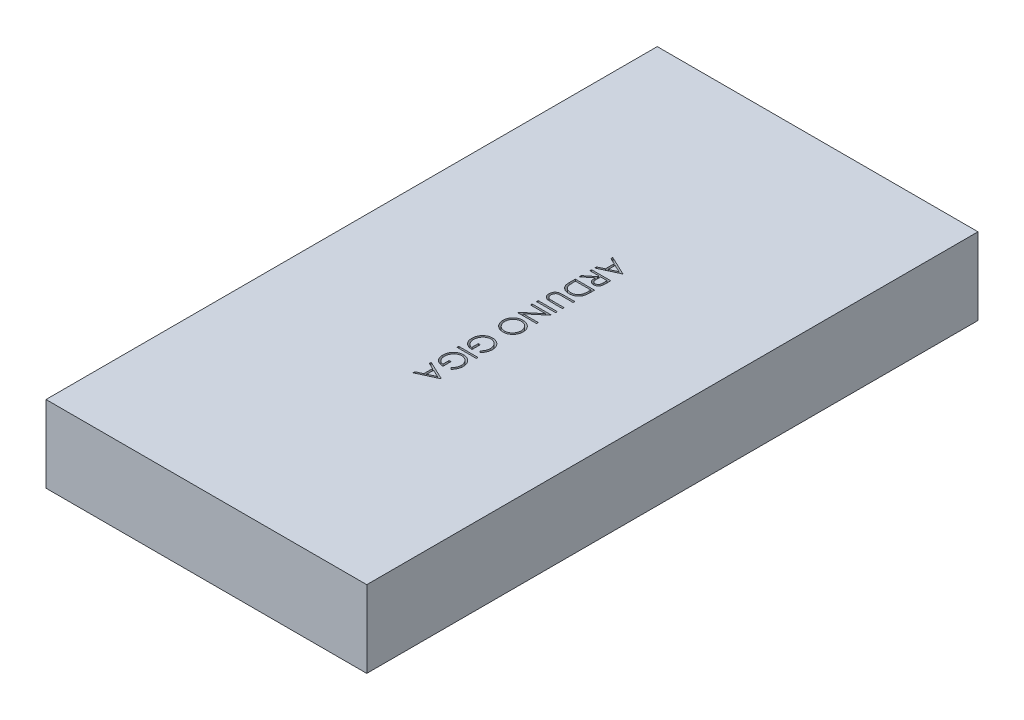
from build123d import *

# Parameters (mm, degrees)
SKETCH1_W           = 53
SKETCH1_H           = 101
BOSS_EXTRUDE1_DEPTH = 12.7
SKETCH2_W           = 3.175
SKETCH2_H           = 0.284935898
CUT_EXTRUDE1_DEPTH  = 6.35


with BuildPart() as part:
    # Sketch1 → Boss-Extrude1 (new body)
    with BuildSketch(Plane(origin=(0, 0, 0), x_dir=(1, 0, 0), z_dir=(0, 1, 0))):
        with Locations((26.5, 50.5)):
            Rectangle(SKETCH1_W, SKETCH1_H)
    extrude(amount=BOSS_EXTRUDE1_DEPTH)

    # Sketch2 → Cut-Extrude1 (cut)
    # profile 1 of 11: a face of its own
    with BuildSketch(Plane(origin=(0, 12.7, 0), x_dir=(1, 0, 0), z_dir=(0, 1, 0))):
        Polygon((29.675, 65.601602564), (26.5, 64.136217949), (26.5, 64.445958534), (27.517628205, 64.915339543), (27.517628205, 66.354647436), (26.5, 66.836748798), (26.5, 67.148397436), (29.675, 65.642307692), align=None)
        Polygon((29.05551883, 65.625135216), (27.843269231, 66.199459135), (27.843269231, 65.065439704), align=None, mode=Mode.SUBTRACT)
    # profile 2 of 11: a face of its own
    with BuildSketch(Plane(origin=(0, 12.7, 0), x_dir=(1, 0, 0), z_dir=(0, 1, 0))):
        with BuildLine():
            Line((29.675, 63.64775641), (29.675, 63.0123748))
            add(Edge.make_bspline(
                [(29.675, 63.0123748), (29.674858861, 62.969973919), (29.674587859, 62.888559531), (29.673076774, 62.771925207), (29.668745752, 62.66594634), (29.66501868, 62.570678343), (29.658222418, 62.486122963), (29.651726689, 62.412020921), (29.643223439, 62.34871351), (29.635326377, 62.310390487), (29.631750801, 62.293038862)],
                knots=[0, 0, 0, 0, 1.410062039, 2.707475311, 3.878576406, 4.937260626, 5.877586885, 6.699081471, 7.410979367, 8, 8, 8, 8], degree=3))
            add(Edge.make_bspline(
                [(29.631750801, 62.293038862), (29.626012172, 62.269809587), (29.614657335, 62.22384658), (29.590645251, 62.157676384), (29.562903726, 62.094595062), (29.53006737, 62.034839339), (29.492708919, 61.978403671), (29.450610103, 61.925372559), (29.403556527, 61.876049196), (29.352749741, 61.830054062), (29.297746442, 61.788360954), (29.239347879, 61.752281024), (29.1779193, 61.721385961), (29.113246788, 61.696721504), (29.045877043, 61.676879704), (28.9752218, 61.662884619), (28.901596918, 61.654492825), (28.851379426, 61.653638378), (28.825916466, 61.653205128)],
                knots=[0, 0, 0, 0, 1.02737288, 2.032829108, 3.019628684, 3.985738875, 4.958353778, 5.924249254, 6.890702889, 7.883913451, 8.865824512, 9.85161466, 10.829249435, 11.81541824, 12.821369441, 13.843154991, 14.906364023, 16, 16, 16, 16], degree=3))
            add(Edge.make_bspline(
                [(28.825916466, 61.653205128), (28.783611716, 61.654537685), (28.70106419, 61.657137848), (28.581266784, 61.681381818), (28.469513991, 61.721091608), (28.365961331, 61.775819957), (28.272572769, 61.84548211), (28.190823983, 61.929200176), (28.121783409, 62.026546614), (28.07441549, 62.117595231), (28.043936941, 62.198060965), (28.022384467, 62.264499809), (28.006013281, 62.337028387), (27.99113416, 62.414606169), (27.979780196, 62.497832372), (27.971716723, 62.586539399), (27.966531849, 62.680949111), (27.965774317, 62.745664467), (27.965384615, 62.77895633)],
                knots=[0, 0, 0, 0, 1.260402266, 2.459371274, 3.627181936, 4.786749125, 5.93865593, 7.087644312, 8.261344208, 9.485713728, 10.136162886, 10.825977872, 11.566646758, 12.35154167, 13.181268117, 14.0701832, 15.007234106, 16, 16, 16, 16], degree=3))
            Line((27.965384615, 62.77895633), (26.5, 61.6125))
            Line((26.5, 61.6125), (26.5, 61.964853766))
            Line((26.5, 61.964853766), (27.965384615, 63.131310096))
            Line((27.965384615, 63.131310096), (27.965384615, 63.362820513))
            Line((27.965384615, 63.362820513), (26.5, 63.362820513))
            Line((26.5, 63.362820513), (26.5, 63.64775641))
            Line((26.5, 63.64775641), (29.675, 63.64775641))
        make_face()
        with BuildLine():
            Line((29.349358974, 63.362820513), (28.291025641, 63.362820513))
            Line((28.291025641, 63.362820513), (28.286573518, 62.781500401))
            add(Edge.make_bspline(
                [(28.286573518, 62.781500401), (28.28656151, 62.754358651), (28.286538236, 62.70175021), (28.290161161, 62.62564032), (28.294282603, 62.554774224), (28.300586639, 62.489422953), (28.30871112, 62.429557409), (28.318873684, 62.375207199), (28.330714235, 62.326284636), (28.349038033, 62.269224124), (28.378085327, 62.205526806), (28.420274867, 62.13621561), (28.47368347, 62.077391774), (28.533784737, 62.026674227), (28.601223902, 61.987608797), (28.673007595, 61.959176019), (28.748516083, 61.941332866), (28.800379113, 61.939211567), (28.826552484, 61.938141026)],
                knots=[0, 0, 0, 0, 1.14660753, 2.222451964, 3.218720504, 4.145691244, 4.995719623, 5.770487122, 6.480909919, 7.121111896, 8.299844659, 9.430703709, 10.534634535, 11.641396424, 12.741395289, 13.810956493, 14.895269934, 16, 16, 16, 16], degree=3))
            add(Edge.make_bspline(
                [(28.826552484, 61.938141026), (28.852092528, 61.939214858), (28.902703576, 61.941342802), (28.976593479, 61.959210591), (29.046830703, 61.988064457), (29.11207648, 62.028524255), (29.171795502, 62.077413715), (29.222186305, 62.135477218), (29.264385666, 62.199790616), (29.291155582, 62.259943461), (29.307600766, 62.313671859), (29.319158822, 62.360328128), (29.328523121, 62.413246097), (29.335803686, 62.472298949), (29.342355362, 62.537379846), (29.346603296, 62.608666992), (29.349170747, 62.686078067), (29.349294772, 62.73973301), (29.349358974, 62.767508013)],
                knots=[0, 0, 0, 0, 1.100801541, 2.181386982, 3.260112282, 4.364594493, 5.481957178, 6.577424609, 7.668452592, 8.790448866, 9.403819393, 10.091598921, 10.863153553, 11.720938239, 12.658472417, 13.685008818, 14.801622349, 16, 16, 16, 16], degree=3))
            Line((29.349358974, 62.767508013), (29.349358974, 63.362820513))
        make_face(mode=Mode.SUBTRACT)
    # profile 3 of 11: a face of its own
    with BuildSketch(Plane(origin=(0, 12.7, 0), x_dir=(1, 0, 0), z_dir=(0, 1, 0))):
        with BuildLine():
            Line((26.5, 60.961217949), (29.675, 60.961217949))
            Line((29.675, 60.961217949), (29.675, 60.320112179))
            add(Edge.make_bspline(
                [(29.675, 60.320112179), (29.67459962, 60.26435091), (29.673826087, 60.156620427), (29.668893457, 60.000944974), (29.660255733, 59.85711086), (29.647431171, 59.725199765), (29.632038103, 59.604999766), (29.612461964, 59.496703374), (29.589439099, 59.400135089), (29.569802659, 59.340745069), (29.560516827, 59.312660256)],
                knots=[0, 0, 0, 0, 1.314317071, 2.539253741, 3.67075822, 4.709970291, 5.662644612, 6.526156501, 7.303037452, 8, 8, 8, 8], degree=3))
            add(Edge.make_bspline(
                [(29.560516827, 59.312660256), (29.546518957, 59.275925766), (29.518840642, 59.203289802), (29.466629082, 59.099868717), (29.407470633, 59.00251054), (29.341292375, 58.910685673), (29.2662016, 58.826519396), (29.185458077, 58.746618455), (29.095762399, 58.674569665), (29.000160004, 58.60748167), (28.89768105, 58.548778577), (28.790405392, 58.497009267), (28.678533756, 58.452807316), (28.56125188, 58.41831762), (28.439685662, 58.389823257), (28.312914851, 58.370704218), (28.181678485, 58.358004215), (28.092619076, 58.356734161), (28.047430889, 58.356089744)],
                knots=[0, 0, 0, 0, 0.98467389, 1.947018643, 2.898343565, 3.837828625, 4.779009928, 5.722093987, 6.681368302, 7.658573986, 8.646467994, 9.637429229, 10.641859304, 11.657149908, 12.698561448, 13.768651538, 14.867827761, 16, 16, 16, 16], degree=3))
            add(Edge.make_bspline(
                [(28.047430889, 58.356089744), (28.008186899, 58.356660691), (27.930852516, 58.357785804), (27.816876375, 58.36787618), (27.706290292, 58.382570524), (27.599579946, 58.405216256), (27.496026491, 58.433042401), (27.396121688, 58.467388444), (27.299792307, 58.50809183), (27.207823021, 58.555315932), (27.120365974, 58.606953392), (27.038926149, 58.663570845), (26.961954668, 58.721919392), (26.892923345, 58.786498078), (26.827884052, 58.852856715), (26.770350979, 58.924514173), (26.717818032, 58.999135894), (26.670668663, 59.078159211), (26.629761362, 59.163478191), (26.594716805, 59.256257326), (26.565861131, 59.356993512), (26.541747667, 59.465532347), (26.522630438, 59.582086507), (26.509814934, 59.706762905), (26.501149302, 59.83937214), (26.500390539, 59.930430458), (26.5, 59.977298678)],
                knots=[0, 0, 0, 0, 1.105818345, 2.179130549, 3.222742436, 4.24813173, 5.251184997, 6.243232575, 7.223185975, 8.195898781, 9.155064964, 10.083206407, 10.990357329, 11.874224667, 12.744762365, 13.607037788, 14.46074101, 15.315384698, 16.197310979, 17.123950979, 18.107232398, 19.148086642, 20.256146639, 21.433991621, 22.679261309, 24, 24, 24, 24], degree=3))
            Line((26.5, 59.977298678), (26.5, 60.961217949))
        make_face()
        with BuildLine():
            Line((26.825641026, 60.676282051), (26.825641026, 60.31184395))
            add(Edge.make_bspline(
                [(26.825641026, 60.31184395), (26.825866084, 60.259476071), (26.826298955, 60.158753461), (26.830097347, 60.013920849), (26.836303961, 59.881587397), (26.844989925, 59.761734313), (26.856482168, 59.65442927), (26.869295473, 59.559448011), (26.885258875, 59.477101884), (26.899728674, 59.427273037), (26.906415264, 59.404246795)],
                knots=[0, 0, 0, 0, 1.375205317, 2.645023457, 3.804390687, 4.853969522, 5.800190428, 6.637939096, 7.370582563, 8, 8, 8, 8], degree=3))
            add(Edge.make_bspline(
                [(26.906415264, 59.404246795), (26.916621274, 59.375264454), (26.936789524, 59.317992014), (26.973592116, 59.235558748), (27.017132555, 59.158639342), (27.065816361, 59.085950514), (27.120397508, 59.01796295), (27.181041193, 58.954978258), (27.247076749, 58.896548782), (27.318751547, 58.843313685), (27.395602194, 58.795745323), (27.476650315, 58.754284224), (27.561700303, 58.719105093), (27.651058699, 58.690499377), (27.744641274, 58.668331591), (27.842201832, 58.652559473), (27.943770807, 58.642754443), (28.012851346, 58.641609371), (28.048066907, 58.641025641)],
                knots=[0, 0, 0, 0, 0.998463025, 1.973077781, 2.929496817, 3.867873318, 4.813809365, 5.759268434, 6.706333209, 7.676553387, 8.657505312, 9.640584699, 10.632319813, 11.645628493, 12.686877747, 13.755137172, 14.855624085, 16, 16, 16, 16], degree=3))
            add(Edge.make_bspline(
                [(28.048066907, 58.641025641), (28.085199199, 58.641491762), (28.158145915, 58.642407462), (28.265183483, 58.653897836), (28.368115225, 58.670725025), (28.467015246, 58.694929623), (28.561754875, 58.726199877), (28.652869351, 58.763617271), (28.739186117, 58.80904786), (28.821436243, 58.86048009), (28.898374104, 58.918222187), (28.969098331, 58.98201801), (29.033740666, 59.051194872), (29.09240403, 59.125433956), (29.144045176, 59.205773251), (29.189984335, 59.290853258), (29.229016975, 59.381872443), (29.249769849, 59.445203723), (29.260316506, 59.477388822)],
                knots=[0, 0, 0, 0, 1.122272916, 2.204715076, 3.251197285, 4.274229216, 5.279697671, 6.265416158, 7.248880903, 8.225321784, 9.195852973, 10.153576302, 11.101466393, 12.055578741, 13.010401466, 13.985536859, 14.976245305, 16, 16, 16, 16], degree=3))
            add(Edge.make_bspline(
                [(29.260316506, 59.477388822), (29.267679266, 59.504014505), (29.283334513, 59.560628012), (29.300411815, 59.653010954), (29.315474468, 59.756983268), (29.328227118, 59.873006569), (29.337377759, 60.000948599), (29.344246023, 60.140907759), (29.348878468, 60.292944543), (29.349194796, 60.398338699), (29.349358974, 60.453039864)],
                knots=[0, 0, 0, 0, 0.674548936, 1.434276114, 2.292660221, 3.240891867, 4.284742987, 5.42552168, 6.663806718, 8, 8, 8, 8], degree=3))
            Line((29.349358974, 60.453039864), (29.349358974, 60.676282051))
            Line((29.349358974, 60.676282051), (26.825641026, 60.676282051))
        make_face(mode=Mode.SUBTRACT)
    # profile 4 of 11: a face of its own
    with BuildSketch(Plane(origin=(0, 12.7, 0), x_dir=(1, 0, 0), z_dir=(0, 1, 0))):
        with BuildLine():
            Line((29.675, 57.704807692), (29.675, 57.419871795))
            Line((29.675, 57.419871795), (27.772671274, 57.419871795))
            add(Edge.make_bspline(
                [(27.772671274, 57.419871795), (27.745746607, 57.419914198), (27.69465241, 57.419994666), (27.621928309, 57.419457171), (27.557274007, 57.417951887), (27.500440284, 57.417002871), (27.451687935, 57.414891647), (27.410752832, 57.413169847), (27.377828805, 57.410955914), (27.358614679, 57.408295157), (27.350355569, 57.407151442)],
                knots=[0, 0, 0, 0, 1.528628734, 2.90083645, 4.128790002, 5.200304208, 6.127813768, 6.898992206, 7.526736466, 8, 8, 8, 8], degree=3))
            add(Edge.make_bspline(
                [(27.350355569, 57.407151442), (27.320556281, 57.402459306), (27.26263679, 57.39333942), (27.180205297, 57.370012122), (27.105659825, 57.337695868), (27.037513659, 57.29834903), (26.976779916, 57.247748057), (26.92039437, 57.18752284), (26.871681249, 57.113875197), (26.826865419, 57.032036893), (26.790896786, 56.94377387), (26.763685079, 56.853596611), (26.74710438, 56.762842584), (26.745184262, 56.702085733), (26.744230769, 56.671915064)],
                knots=[0, 0, 0, 0, 1.035924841, 2.013479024, 2.933602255, 3.82183108, 4.706948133, 5.639927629, 6.646101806, 7.731477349, 8.84205456, 9.913728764, 10.963998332, 12, 12, 12, 12], degree=3))
            add(Edge.make_bspline(
                [(26.744230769, 56.671915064), (26.745204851, 56.646012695), (26.747147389, 56.594357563), (26.759178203, 56.517608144), (26.780856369, 56.442856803), (26.808844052, 56.369750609), (26.84576491, 56.301177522), (26.888709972, 56.237186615), (26.938348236, 56.17946385), (26.99406505, 56.127408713), (27.056356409, 56.081832), (27.125034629, 56.043377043), (27.199873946, 56.010966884), (27.252646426, 55.995083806), (27.279757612, 55.986924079)],
                knots=[0, 0, 0, 0, 0.994510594, 1.983277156, 2.972612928, 3.9776239, 4.982470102, 5.955333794, 6.930747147, 7.898149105, 8.876444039, 9.885893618, 10.913904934, 12, 12, 12, 12], degree=3))
            add(Edge.make_bspline(
                [(27.279757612, 55.986924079), (27.290959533, 55.984202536), (27.315921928, 55.978137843), (27.358123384, 55.972470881), (27.407915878, 55.966568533), (27.465657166, 55.962473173), (27.531153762, 55.958480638), (27.604746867, 55.956092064), (27.686169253, 55.954988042), (27.742990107, 55.954659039), (27.772671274, 55.954487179)],
                knots=[0, 0, 0, 0, 0.558680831, 1.244966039, 2.062412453, 2.990489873, 4.051219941, 5.244515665, 6.560634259, 8, 8, 8, 8], degree=3))
            Line((27.772671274, 55.954487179), (29.675, 55.954487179))
            Line((29.675, 55.954487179), (29.675, 55.669551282))
            Line((29.675, 55.669551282), (27.757406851, 55.669551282))
            add(Edge.make_bspline(
                [(27.757406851, 55.669551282), (27.722845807, 55.669779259), (27.655397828, 55.670224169), (27.556568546, 55.674160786), (27.462794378, 55.68025608), (27.374194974, 55.689470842), (27.290664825, 55.699643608), (27.212325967, 55.714198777), (27.13865312, 55.729414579), (27.069772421, 55.748660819), (27.004772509, 55.771878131), (26.941938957, 55.799061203), (26.881785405, 55.832323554), (26.823443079, 55.870280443), (26.766832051, 55.912422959), (26.713281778, 55.960997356), (26.661036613, 56.013488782), (26.611820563, 56.071002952), (26.566364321, 56.13251202), (26.527262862, 56.19812525), (26.492929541, 56.266521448), (26.465809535, 56.338433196), (26.444818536, 56.4133921), (26.429370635, 56.491394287), (26.420557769, 56.572705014), (26.419251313, 56.628009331), (26.418589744, 56.656014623)],
                knots=[0, 0, 0, 0, 1.316364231, 2.568964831, 3.766826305, 4.894964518, 5.961692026, 6.970710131, 7.928946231, 8.826316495, 9.692177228, 10.556379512, 11.43093279, 12.306715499, 13.20629939, 14.115652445, 15.057829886, 16.025681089, 16.996391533, 17.967202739, 18.931442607, 19.907779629, 20.889445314, 21.893507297, 22.933303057, 24, 24, 24, 24], degree=3))
            add(Edge.make_bspline(
                [(26.418589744, 56.656014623), (26.419301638, 56.686557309), (26.420698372, 56.74648195), (26.428701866, 56.834781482), (26.443777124, 56.919430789), (26.462972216, 57.001323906), (26.489446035, 57.0793459), (26.520377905, 57.154542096), (26.558366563, 57.225624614), (26.600633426, 57.293746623), (26.648190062, 57.357087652), (26.700024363, 57.415233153), (26.755305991, 57.468279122), (26.814633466, 57.515331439), (26.877545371, 57.55716967), (26.944219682, 57.593210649), (27.014630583, 57.624156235), (27.063573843, 57.640127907), (27.088316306, 57.648202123)],
                knots=[0, 0, 0, 0, 1.13879206, 2.234305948, 3.301075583, 4.341971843, 5.366689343, 6.369221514, 7.369726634, 8.367512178, 9.355451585, 10.318319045, 11.268648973, 12.207971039, 13.137398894, 14.081662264, 15.030215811, 16, 16, 16, 16], degree=3))
            add(Edge.make_bspline(
                [(27.088316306, 57.648202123), (27.105218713, 57.652898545), (27.14188041, 57.663085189), (27.20255601, 57.673993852), (27.272419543, 57.683164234), (27.351475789, 57.691787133), (27.439786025, 57.696875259), (27.53731197, 57.701336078), (27.64417155, 57.704839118), (27.718606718, 57.70481846), (27.757406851, 57.704807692)],
                knots=[0, 0, 0, 0, 0.625038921, 1.35572334, 2.194682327, 3.136881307, 4.189498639, 5.346923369, 6.617055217, 8, 8, 8, 8], degree=3))
            Line((27.757406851, 57.704807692), (29.675, 57.704807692))
        make_face()
    # profile 5 of 11: a face of its own
    with BuildSketch(Plane(origin=(0, 12.7, 0), x_dir=(1, 0, 0), z_dir=(0, 1, 0))):
        with Locations((28.0875, 54.672275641)):
            Rectangle(SKETCH2_W, SKETCH2_H)
    # profile 6 of 11: a face of its own
    with BuildSketch(Plane(origin=(0, 12.7, 0), x_dir=(1, 0, 0), z_dir=(0, 1, 0))):
        Polygon((26.5, 53.837820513), (29.675, 53.837820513), (29.675, 53.778034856), (27.176086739, 51.680448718), (29.675, 51.680448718), (29.675, 51.395512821), (26.5, 51.395512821), (26.5, 51.460386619), (28.993189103, 53.552884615), (26.5, 53.552884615), align=None)
    # profile 7 of 11: a face of its own
    with BuildSketch(Plane(origin=(0, 12.7, 0), x_dir=(1, 0, 0), z_dir=(0, 1, 0))):
        with BuildLine():
            add(Edge.make_bspline(
                [(29.756410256, 49.095673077), (29.754921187, 49.036882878), (29.751996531, 48.921414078), (29.729609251, 48.751710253), (29.690877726, 48.589699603), (29.639297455, 48.434058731), (29.570477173, 48.286662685), (29.487341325, 48.146352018), (29.388707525, 48.013523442), (29.276230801, 47.889394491), (29.153405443, 47.776221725), (29.02195078, 47.677343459), (28.883666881, 47.593742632), (28.738072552, 47.525220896), (28.585808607, 47.471416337), (28.426009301, 47.434300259), (28.259724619, 47.41058831), (28.146307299, 47.407816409), (28.088772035, 47.406410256)],
                knots=[0, 0, 0, 0, 1.06508495, 2.091914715, 3.094501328, 4.079693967, 5.057647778, 6.035986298, 7.030177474, 8.050107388, 9.066943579, 10.051896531, 11.025616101, 11.9896488, 12.96281505, 13.945825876, 14.957941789, 16, 16, 16, 16], degree=3))
            add(Edge.make_bspline(
                [(28.088772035, 47.406410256), (28.031660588, 47.407816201), (27.91908731, 47.410587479), (27.753857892, 47.434327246), (27.595023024, 47.471553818), (27.442863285, 47.524721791), (27.297160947, 47.592914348), (27.158622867, 47.677080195), (27.026258, 47.775303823), (26.902836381, 47.888085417), (26.789441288, 48.010881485), (26.690409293, 48.14270684), (26.605779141, 48.280854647), (26.53772739, 48.426360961), (26.483542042, 48.577603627), (26.446563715, 48.735968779), (26.4227203, 48.900749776), (26.419981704, 49.013118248), (26.418589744, 49.070232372)],
                knots=[0, 0, 0, 0, 1.04355943, 2.056976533, 3.044937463, 4.02179873, 4.997890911, 5.980248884, 6.980147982, 8.006253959, 9.032111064, 10.031228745, 11.015595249, 11.988180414, 12.962670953, 13.946861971, 14.95644057, 16, 16, 16, 16], degree=3))
            add(Edge.make_bspline(
                [(26.418589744, 49.070232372), (26.41999507, 49.127767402), (26.422765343, 49.241184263), (26.446518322, 49.40767696), (26.483648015, 49.567591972), (26.536760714, 49.720436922), (26.60514423, 49.866261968), (26.689177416, 50.005053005), (26.788198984, 50.136976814), (26.900830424, 50.260690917), (27.023685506, 50.373748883), (27.154644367, 50.473189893), (27.292461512, 50.556738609), (27.436568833, 50.625150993), (27.586593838, 50.679262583), (27.74348024, 50.716191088), (27.906348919, 50.740080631), (28.017240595, 50.742833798), (28.073507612, 50.744230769)],
                knots=[0, 0, 0, 0, 1.053167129, 2.076072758, 3.073341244, 4.055601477, 5.033424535, 6.017524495, 7.021518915, 8.049444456, 9.077120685, 10.074910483, 11.055688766, 12.022980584, 12.991883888, 13.970269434, 14.970104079, 16, 16, 16, 16], degree=3))
            add(Edge.make_bspline(
                [(28.073507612, 50.744230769), (28.111274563, 50.743746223), (28.186332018, 50.742783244), (28.297787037, 50.731172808), (28.407461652, 50.714359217), (28.514987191, 50.690136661), (28.620381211, 50.658891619), (28.723428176, 50.620387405), (28.82497689, 50.57626156), (28.923094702, 50.523723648), (29.017935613, 50.466403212), (29.108313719, 50.403901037), (29.19261462, 50.335781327), (29.272192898, 50.263017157), (29.345690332, 50.184601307), (29.414709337, 50.101713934), (29.478535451, 50.013921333), (29.535828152, 49.921084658), (29.588452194, 49.825570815), (29.632388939, 49.726686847), (29.671223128, 49.626519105), (29.702084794, 49.524185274), (29.72664469, 49.419922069), (29.74333252, 49.313599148), (29.754968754, 49.205326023), (29.755927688, 49.132381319), (29.756410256, 49.095673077)],
                knots=[0, 0, 0, 0, 1.037115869, 2.061148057, 3.07517727, 4.084041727, 5.086514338, 6.092668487, 7.104487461, 8.125783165, 9.147610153, 10.147694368, 11.141876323, 12.122903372, 13.107606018, 14.091946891, 15.084523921, 16.086505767, 17.087268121, 18.077809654, 19.05670789, 20.036870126, 21.011670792, 21.99694167, 22.991993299, 24, 24, 24, 24], degree=3))
        make_face()
        with BuildLine():
            add(Edge.make_bspline(
                [(29.430769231, 49.081680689), (29.430402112, 49.111811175), (29.429671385, 49.171784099), (29.420038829, 49.260941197), (29.406323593, 49.348930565), (29.386709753, 49.435747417), (29.360231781, 49.520924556), (29.329033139, 49.605312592), (29.292332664, 49.688506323), (29.249538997, 49.769575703), (29.202791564, 49.848385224), (29.151484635, 49.923260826), (29.095866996, 49.993455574), (29.036673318, 50.059194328), (28.973301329, 50.120285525), (28.90676245, 50.177967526), (28.835141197, 50.229918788), (28.760383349, 50.27753082), (28.6825853, 50.32013733), (28.602566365, 50.358024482), (28.519673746, 50.389016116), (28.434806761, 50.414291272), (28.348099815, 50.435246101), (28.258895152, 50.44852116), (28.167641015, 50.458256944), (28.105971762, 50.458946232), (28.074779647, 50.459294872)],
                knots=[0, 0, 0, 0, 1.008585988, 2.007529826, 2.999688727, 3.990042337, 4.984966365, 5.984641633, 7.001812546, 8.027570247, 9.052811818, 10.068991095, 11.064725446, 12.050001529, 13.029093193, 14.010961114, 14.996492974, 15.989185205, 16.977398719, 17.96520407, 18.951579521, 19.937648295, 20.929603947, 21.935788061, 22.955928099, 24, 24, 24, 24], degree=3))
            add(Edge.make_bspline(
                [(28.074779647, 50.459294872), (28.02891249, 50.45813839), (27.938677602, 50.455863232), (27.806445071, 50.435944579), (27.679364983, 50.405263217), (27.55813268, 50.360035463), (27.44170608, 50.303474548), (27.331118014, 50.233600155), (27.226338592, 50.150815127), (27.128099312, 50.0567775), (27.038432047, 49.953977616), (26.959725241, 49.844818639), (26.893131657, 49.73047001), (26.838879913, 49.610633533), (26.79589065, 49.48594898), (26.766427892, 49.355612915), (26.747037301, 49.22049357), (26.745175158, 49.128390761), (26.744230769, 49.081680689)],
                knots=[0, 0, 0, 0, 1.032063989, 2.030389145, 3.003944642, 3.970395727, 4.937377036, 5.913328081, 6.909231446, 7.93887556, 8.970685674, 9.976071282, 10.964166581, 11.944589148, 12.933237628, 13.927779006, 14.949070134, 16, 16, 16, 16], degree=3))
            add(Edge.make_bspline(
                [(26.744230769, 49.081680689), (26.744662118, 49.050284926), (26.745517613, 48.988017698), (26.754134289, 48.895402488), (26.7679517, 48.804455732), (26.787846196, 48.715305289), (26.812743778, 48.628051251), (26.842327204, 48.542333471), (26.879217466, 48.459049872), (26.920042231, 48.377206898), (26.966247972, 48.298852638), (27.016837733, 48.224513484), (27.071460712, 48.154620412), (27.13014036, 48.089022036), (27.192370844, 48.027507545), (27.259752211, 47.971747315), (27.330316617, 47.919173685), (27.405248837, 47.871752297), (27.483210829, 47.829230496), (27.563532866, 47.792255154), (27.645938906, 47.760866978), (27.730568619, 47.735533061), (27.817255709, 47.71567949), (27.906117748, 47.701999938), (27.996976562, 47.692430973), (28.058429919, 47.691709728), (28.089408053, 47.691346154)],
                knots=[0, 0, 0, 0, 1.047226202, 2.076964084, 3.100341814, 4.114585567, 5.122123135, 6.126552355, 7.137064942, 8.158803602, 9.176592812, 10.169297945, 11.156925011, 12.133779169, 13.104132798, 14.073170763, 15.049307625, 16.038276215, 17.028988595, 18.010110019, 18.986169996, 19.968539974, 20.955178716, 21.950601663, 22.966915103, 24, 24, 24, 24], degree=3))
            add(Edge.make_bspline(
                [(28.089408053, 47.691346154), (28.12017426, 47.691710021), (28.1812047, 47.692431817), (28.271429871, 47.701995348), (28.359652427, 47.715694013), (28.44552602, 47.735435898), (28.529072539, 47.760881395), (28.610213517, 47.792257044), (28.689251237, 47.829255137), (28.765990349, 47.871716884), (28.839627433, 47.919446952), (28.910023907, 47.971602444), (28.975857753, 48.029083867), (29.038754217, 48.090248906), (29.097371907, 48.156625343), (29.151730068, 48.22791256), (29.203141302, 48.303244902), (29.249517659, 48.38300799), (29.292354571, 48.465323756), (29.329024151, 48.549798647), (29.36036671, 48.635623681), (29.386601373, 48.722359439), (29.406342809, 48.81061694), (29.420033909, 48.899882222), (29.429672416, 48.990307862), (29.430402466, 49.051126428), (29.430769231, 49.081680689)],
                knots=[0, 0, 0, 0, 1.029967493, 2.04313025, 3.035375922, 4.01889446, 4.991458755, 5.958017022, 6.930036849, 7.912118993, 8.892942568, 9.867138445, 10.843712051, 11.817804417, 12.803729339, 13.806387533, 14.818654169, 15.856205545, 16.894655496, 17.924916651, 18.938004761, 19.953404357, 20.957695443, 21.963967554, 22.97713031, 24, 24, 24, 24], degree=3))
        make_face(mode=Mode.SUBTRACT)
    # profile 8 of 11: a face of its own
    with BuildSketch(Plane(origin=(0, 12.7, 0), x_dir=(1, 0, 0), z_dir=(0, 1, 0))):
        with BuildLine():
            Line((29.133112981, 42.5625), (28.901602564, 42.806730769))
            add(Edge.make_bspline(
                [(28.901602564, 42.806730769), (28.943106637, 42.851193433), (29.024904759, 42.938822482), (29.132390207, 43.080760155), (29.222851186, 43.229647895), (29.297735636, 43.38327121), (29.356944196, 43.538887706), (29.398871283, 43.694001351), (29.426025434, 43.846937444), (29.429201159, 43.948486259), (29.430769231, 43.998627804)],
                knots=[0, 0, 0, 0, 1.09204548, 2.152253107, 3.191356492, 4.216655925, 5.218178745, 6.177092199, 7.099906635, 8, 8, 8, 8], degree=3))
            add(Edge.make_bspline(
                [(29.430769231, 43.998627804), (29.430393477, 44.02939311), (29.429642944, 44.090843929), (29.420086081, 44.182124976), (29.406298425, 44.272436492), (29.386554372, 44.36146704), (29.360910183, 44.449570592), (29.329948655, 44.53655116), (29.292677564, 44.622240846), (29.250185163, 44.706188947), (29.203797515, 44.787988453), (29.152062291, 44.864922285), (29.096568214, 44.937306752), (29.036599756, 45.004646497), (28.973110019, 45.067802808), (28.905235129, 45.125955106), (28.833467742, 45.179395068), (28.757814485, 45.227506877), (28.679995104, 45.270464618), (28.600719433, 45.308462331), (28.520070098, 45.340049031), (28.438514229, 45.366261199), (28.355881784, 45.386796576), (28.2721706, 45.401488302), (28.187094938, 45.409712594), (28.130129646, 45.41114093), (28.101492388, 45.411858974)],
                knots=[0, 0, 0, 0, 1.028345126, 2.054023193, 3.065714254, 4.082262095, 5.100859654, 6.132352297, 7.167492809, 8.223256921, 9.277568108, 10.309840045, 11.320860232, 12.32524711, 13.322830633, 14.313234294, 15.3114222, 16.312425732, 17.308799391, 18.282312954, 19.249923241, 20.202773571, 21.145015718, 22.094907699, 23.042283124, 24, 24, 24, 24], degree=3))
            add(Edge.make_bspline(
                [(28.101492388, 45.411858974), (28.072219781, 45.411167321), (28.013754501, 45.409785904), (27.926468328, 45.401113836), (27.840645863, 45.384514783), (27.755332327, 45.364067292), (27.671632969, 45.335588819), (27.588610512, 45.302011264), (27.507024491, 45.261760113), (27.427371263, 45.21530763), (27.349791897, 45.164331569), (27.276712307, 45.107235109), (27.207162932, 45.0465825), (27.142687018, 44.980167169), (27.08156021, 44.910117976), (27.025466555, 44.834342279), (26.973325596, 44.754330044), (26.925794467, 44.669959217), (26.883332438, 44.582145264), (26.845573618, 44.492105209), (26.814477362, 44.399551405), (26.789133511, 44.304970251), (26.76835967, 44.208474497), (26.754995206, 44.109574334), (26.745297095, 44.008996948), (26.744588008, 43.941198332), (26.744230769, 43.907041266)],
                knots=[0, 0, 0, 0, 0.935842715, 1.869129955, 2.799583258, 3.728257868, 4.6712142, 5.62263184, 6.589468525, 7.576334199, 8.568768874, 9.554260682, 10.538610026, 11.516240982, 12.510802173, 13.508383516, 14.52719334, 15.561971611, 16.601598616, 17.64369662, 18.68095744, 19.719943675, 20.77263142, 21.833597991, 22.908562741, 24, 24, 24, 24], degree=3))
            add(Edge.make_bspline(
                [(26.744230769, 43.907041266), (26.745091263, 43.865876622), (26.746780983, 43.785043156), (26.759934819, 43.666219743), (26.78047869, 43.552098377), (26.810564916, 43.442999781), (26.848940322, 43.338797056), (26.895200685, 43.23910888), (26.951118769, 43.144717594), (27.014235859, 43.055348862), (27.084539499, 42.972997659), (27.160465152, 42.898821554), (27.241269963, 42.83362204), (27.32766765, 42.777941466), (27.41827665, 42.729973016), (27.514710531, 42.691720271), (27.615875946, 42.662130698), (27.685814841, 42.650026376), (27.721153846, 42.643910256)],
                knots=[0, 0, 0, 0, 1.13011591, 2.219166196, 3.278784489, 4.311187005, 5.322345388, 6.325022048, 7.324448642, 8.33076908, 9.325913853, 10.293360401, 11.241630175, 12.171712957, 13.111744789, 14.052245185, 15.015830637, 16, 16, 16, 16], degree=3))
            Line((27.721153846, 42.643910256), (27.721153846, 43.70224359))
            Line((27.721153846, 43.70224359), (28.046794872, 43.70224359))
            Line((28.046794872, 43.70224359), (28.046794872, 42.358974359))
            add(Edge.make_bspline(
                [(28.046794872, 42.358974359), (27.986100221, 42.360521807), (27.867309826, 42.363550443), (27.694072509, 42.384794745), (27.530449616, 42.419099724), (27.376268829, 42.465963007), (27.231748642, 42.52662844), (27.09674232, 42.600444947), (26.972122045, 42.688593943), (26.856870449, 42.787935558), (26.754064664, 42.899423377), (26.663707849, 43.020044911), (26.587596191, 43.149999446), (26.525674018, 43.289164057), (26.477346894, 43.437083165), (26.443082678, 43.594099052), (26.422554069, 43.75999879), (26.419931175, 43.873697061), (26.418589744, 43.931845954)],
                knots=[0, 0, 0, 0, 1.140356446, 2.231883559, 3.274166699, 4.278491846, 5.25512956, 6.21435461, 7.1637429, 8.11826594, 9.068280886, 10.0076534, 10.945064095, 11.891975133, 12.864533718, 13.863980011, 14.907571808, 16, 16, 16, 16], degree=3))
            add(Edge.make_bspline(
                [(26.418589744, 43.931845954), (26.419106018, 43.967687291), (26.420124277, 44.038377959), (26.427360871, 44.142781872), (26.438501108, 44.244307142), (26.455324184, 44.342938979), (26.47592962, 44.439040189), (26.50231543, 44.532130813), (26.53285775, 44.622565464), (26.567597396, 44.710483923), (26.607848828, 44.79508819), (26.652579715, 44.876755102), (26.701559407, 44.955936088), (26.75563496, 45.032091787), (26.814401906, 45.105619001), (26.877978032, 45.176043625), (26.946168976, 45.243759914), (26.994591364, 45.286178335), (27.018990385, 45.307552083)],
                knots=[0, 0, 0, 0, 1.107784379, 2.184907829, 3.233506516, 4.263428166, 5.276301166, 6.270063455, 7.25232949, 8.225834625, 9.190232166, 10.146266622, 11.1027726, 12.066435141, 13.031522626, 14.010570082, 14.99756817, 16, 16, 16, 16], degree=3))
            add(Edge.make_bspline(
                [(27.018990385, 45.307552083), (27.057698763, 45.338563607), (27.134473, 45.400071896), (27.257481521, 45.479245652), (27.384846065, 45.546738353), (27.516921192, 45.601500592), (27.653583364, 45.64426157), (27.79465795, 45.674928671), (27.940326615, 45.692896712), (28.038901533, 45.695485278), (28.088772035, 45.696794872)],
                knots=[0, 0, 0, 0, 1.023165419, 2.029347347, 3.013907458, 3.994755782, 4.975994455, 5.96558838, 6.970761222, 8, 8, 8, 8], degree=3))
            add(Edge.make_bspline(
                [(28.088772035, 45.696794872), (28.126115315, 45.696310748), (28.200327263, 45.695348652), (28.310512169, 45.683733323), (28.41871333, 45.666968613), (28.525030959, 45.642685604), (28.628992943, 45.610735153), (28.731398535, 45.572364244), (28.831836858, 45.527419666), (28.92942362, 45.474976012), (29.024103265, 45.417873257), (29.112977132, 45.353730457), (29.197582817, 45.285706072), (29.276387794, 45.211876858), (29.349735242, 45.132661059), (29.417896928, 45.048497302), (29.481047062, 44.959426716), (29.538168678, 44.865140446), (29.589480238, 44.767053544), (29.634464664, 44.665399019), (29.671642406, 44.560208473), (29.703187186, 44.452269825), (29.726514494, 44.340766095), (29.743431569, 44.226506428), (29.755007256, 44.108895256), (29.755938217, 44.029396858), (29.756410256, 43.98908754)],
                knots=[0, 0, 0, 0, 1.009014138, 2.005204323, 2.991638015, 3.967544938, 4.950092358, 5.929358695, 6.922031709, 7.921874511, 8.922406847, 9.908357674, 10.882125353, 11.855201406, 12.82437151, 13.798139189, 14.780770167, 15.773426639, 16.775664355, 17.771244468, 18.775446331, 19.789330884, 20.808771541, 21.851841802, 22.910785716, 24, 24, 24, 24], degree=3))
            add(Edge.make_bspline(
                [(29.756410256, 43.98908754), (29.755885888, 43.956214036), (29.754846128, 43.89102974), (29.747601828, 43.794036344), (29.736246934, 43.698733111), (29.720369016, 43.604641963), (29.699365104, 43.512121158), (29.673767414, 43.420890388), (29.644130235, 43.331122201), (29.608756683, 43.242923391), (29.568613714, 43.155694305), (29.523425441, 43.068951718), (29.472421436, 42.982991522), (29.415449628, 42.897664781), (29.353488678, 42.812433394), (29.284766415, 42.728645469), (29.211992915, 42.644278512), (29.159666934, 42.590029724), (29.133112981, 42.5625)],
                knots=[0, 0, 0, 0, 0.985875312, 1.954874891, 2.915472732, 3.863573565, 4.815313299, 5.759461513, 6.704487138, 7.649063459, 8.607849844, 9.583336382, 10.581114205, 11.603942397, 12.659508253, 13.739925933, 14.853076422, 16, 16, 16, 16], degree=3))
        make_face()
    # profile 9 of 11: a face of its own
    with BuildSketch(Plane(origin=(0, 12.7, 0), x_dir=(1, 0, 0), z_dir=(0, 1, 0))):
        with Locations((28.0875, 41.565224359)):
            Rectangle(SKETCH2_W, SKETCH2_H)
    # profile 10 of 11: a face of its own
    with BuildSketch(Plane(origin=(0, 12.7, 0), x_dir=(1, 0, 0), z_dir=(0, 1, 0))):
        with BuildLine():
            Line((29.133112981, 37.759294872), (28.901602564, 38.003525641))
            add(Edge.make_bspline(
                [(28.901602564, 38.003525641), (28.943106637, 38.047988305), (29.024904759, 38.135617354), (29.132390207, 38.277555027), (29.222851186, 38.426442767), (29.297735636, 38.580066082), (29.356944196, 38.735682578), (29.398871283, 38.890796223), (29.426025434, 39.043732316), (29.429201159, 39.145281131), (29.430769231, 39.195422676)],
                knots=[0, 0, 0, 0, 1.09204548, 2.152253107, 3.191356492, 4.216655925, 5.218178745, 6.177092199, 7.099906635, 8, 8, 8, 8], degree=3))
            add(Edge.make_bspline(
                [(29.430769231, 39.195422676), (29.430393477, 39.226187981), (29.429642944, 39.2876388), (29.420086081, 39.378919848), (29.406298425, 39.469231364), (29.386554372, 39.558261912), (29.360910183, 39.646365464), (29.329948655, 39.733346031), (29.292677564, 39.819035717), (29.250185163, 39.902983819), (29.203797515, 39.984783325), (29.152062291, 40.061717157), (29.096568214, 40.134101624), (29.036599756, 40.201441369), (28.973110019, 40.26459768), (28.905235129, 40.322749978), (28.833467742, 40.37618994), (28.757814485, 40.424301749), (28.679995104, 40.46725949), (28.600719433, 40.505257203), (28.520070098, 40.536843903), (28.438514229, 40.563056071), (28.355881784, 40.583591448), (28.2721706, 40.598283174), (28.187094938, 40.606507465), (28.130129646, 40.607935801), (28.101492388, 40.608653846)],
                knots=[0, 0, 0, 0, 1.028345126, 2.054023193, 3.065714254, 4.082262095, 5.100859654, 6.132352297, 7.167492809, 8.223256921, 9.277568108, 10.309840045, 11.320860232, 12.32524711, 13.322830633, 14.313234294, 15.3114222, 16.312425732, 17.308799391, 18.282312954, 19.249923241, 20.202773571, 21.145015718, 22.094907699, 23.042283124, 24, 24, 24, 24], degree=3))
            add(Edge.make_bspline(
                [(28.101492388, 40.608653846), (28.072219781, 40.607962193), (28.013754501, 40.606580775), (27.926468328, 40.597908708), (27.840645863, 40.581309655), (27.755332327, 40.560862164), (27.671632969, 40.532383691), (27.588610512, 40.498806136), (27.507024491, 40.458554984), (27.427371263, 40.412102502), (27.349791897, 40.361126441), (27.276712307, 40.30402998), (27.207162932, 40.243377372), (27.142687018, 40.176962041), (27.08156021, 40.106912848), (27.025466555, 40.03113715), (26.973325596, 39.951124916), (26.925794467, 39.866754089), (26.883332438, 39.778940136), (26.845573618, 39.688900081), (26.814477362, 39.596346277), (26.789133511, 39.501765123), (26.76835967, 39.405269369), (26.754995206, 39.306369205), (26.745297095, 39.20579182), (26.744588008, 39.137993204), (26.744230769, 39.103836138)],
                knots=[0, 0, 0, 0, 0.935842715, 1.869129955, 2.799583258, 3.728257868, 4.6712142, 5.62263184, 6.589468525, 7.576334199, 8.568768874, 9.554260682, 10.538610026, 11.516240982, 12.510802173, 13.508383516, 14.52719334, 15.561971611, 16.601598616, 17.64369662, 18.68095744, 19.719943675, 20.77263142, 21.833597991, 22.908562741, 24, 24, 24, 24], degree=3))
            add(Edge.make_bspline(
                [(26.744230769, 39.103836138), (26.745091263, 39.062671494), (26.746780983, 38.981838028), (26.759934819, 38.863014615), (26.78047869, 38.748893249), (26.810564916, 38.639794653), (26.848940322, 38.535591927), (26.895200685, 38.435903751), (26.951118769, 38.341512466), (27.014235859, 38.252143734), (27.084539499, 38.169792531), (27.160465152, 38.095616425), (27.241269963, 38.030416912), (27.32766765, 37.974736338), (27.41827665, 37.926767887), (27.514710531, 37.888515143), (27.615875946, 37.85892557), (27.685814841, 37.846821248), (27.721153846, 37.840705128)],
                knots=[0, 0, 0, 0, 1.13011591, 2.219166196, 3.278784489, 4.311187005, 5.322345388, 6.325022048, 7.324448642, 8.33076908, 9.325913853, 10.293360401, 11.241630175, 12.171712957, 13.111744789, 14.052245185, 15.015830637, 16, 16, 16, 16], degree=3))
            Line((27.721153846, 37.840705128), (27.721153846, 38.899038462))
            Line((27.721153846, 38.899038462), (28.046794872, 38.899038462))
            Line((28.046794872, 38.899038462), (28.046794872, 37.555769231))
            add(Edge.make_bspline(
                [(28.046794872, 37.555769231), (27.986100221, 37.557316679), (27.867309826, 37.560345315), (27.694072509, 37.581589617), (27.530449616, 37.615894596), (27.376268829, 37.662757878), (27.231748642, 37.723423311), (27.09674232, 37.797239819), (26.972122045, 37.885388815), (26.856870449, 37.98473043), (26.754064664, 38.096218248), (26.663707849, 38.216839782), (26.587596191, 38.346794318), (26.525674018, 38.485958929), (26.477346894, 38.633878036), (26.443082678, 38.790893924), (26.422554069, 38.956793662), (26.419931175, 39.070491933), (26.418589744, 39.128640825)],
                knots=[0, 0, 0, 0, 1.140356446, 2.231883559, 3.274166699, 4.278491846, 5.25512956, 6.21435461, 7.1637429, 8.11826594, 9.068280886, 10.0076534, 10.945064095, 11.891975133, 12.864533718, 13.863980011, 14.907571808, 16, 16, 16, 16], degree=3))
            add(Edge.make_bspline(
                [(26.418589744, 39.128640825), (26.419106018, 39.164482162), (26.420124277, 39.235172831), (26.427360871, 39.339576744), (26.438501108, 39.441102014), (26.455324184, 39.539733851), (26.47592962, 39.635835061), (26.50231543, 39.728925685), (26.53285775, 39.819360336), (26.567597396, 39.907278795), (26.607848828, 39.991883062), (26.652579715, 40.073549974), (26.701559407, 40.152730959), (26.75563496, 40.228886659), (26.814401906, 40.302413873), (26.877978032, 40.372838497), (26.946168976, 40.440554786), (26.994591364, 40.482973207), (27.018990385, 40.504346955)],
                knots=[0, 0, 0, 0, 1.107784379, 2.184907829, 3.233506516, 4.263428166, 5.276301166, 6.270063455, 7.25232949, 8.225834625, 9.190232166, 10.146266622, 11.1027726, 12.066435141, 13.031522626, 14.010570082, 14.99756817, 16, 16, 16, 16], degree=3))
            add(Edge.make_bspline(
                [(27.018990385, 40.504346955), (27.057698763, 40.535358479), (27.134473, 40.596866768), (27.257481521, 40.676040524), (27.384846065, 40.743533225), (27.516921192, 40.798295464), (27.653583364, 40.841056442), (27.79465795, 40.871723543), (27.940326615, 40.889691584), (28.038901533, 40.89228015), (28.088772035, 40.893589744)],
                knots=[0, 0, 0, 0, 1.023165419, 2.029347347, 3.013907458, 3.994755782, 4.975994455, 5.96558838, 6.970761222, 8, 8, 8, 8], degree=3))
            add(Edge.make_bspline(
                [(28.088772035, 40.893589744), (28.126115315, 40.893105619), (28.200327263, 40.892143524), (28.310512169, 40.880528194), (28.41871333, 40.863763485), (28.525030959, 40.839480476), (28.628992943, 40.807530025), (28.731398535, 40.769159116), (28.831836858, 40.724214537), (28.92942362, 40.671770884), (29.024103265, 40.614668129), (29.112977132, 40.550525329), (29.197582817, 40.482500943), (29.276387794, 40.40867173), (29.349735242, 40.329455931), (29.417896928, 40.245292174), (29.481047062, 40.156221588), (29.538168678, 40.061935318), (29.589480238, 39.963848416), (29.634464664, 39.862193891), (29.671642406, 39.757003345), (29.703187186, 39.649064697), (29.726514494, 39.537560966), (29.743431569, 39.4233013), (29.755007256, 39.305690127), (29.755938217, 39.226191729), (29.756410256, 39.185882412)],
                knots=[0, 0, 0, 0, 1.009014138, 2.005204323, 2.991638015, 3.967544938, 4.950092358, 5.929358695, 6.922031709, 7.921874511, 8.922406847, 9.908357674, 10.882125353, 11.855201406, 12.82437151, 13.798139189, 14.780770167, 15.773426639, 16.775664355, 17.771244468, 18.775446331, 19.789330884, 20.808771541, 21.851841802, 22.910785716, 24, 24, 24, 24], degree=3))
            add(Edge.make_bspline(
                [(29.756410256, 39.185882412), (29.755885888, 39.153008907), (29.754846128, 39.087824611), (29.747601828, 38.990831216), (29.736246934, 38.895527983), (29.720369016, 38.801436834), (29.699365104, 38.70891603), (29.673767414, 38.617685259), (29.644130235, 38.527917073), (29.608756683, 38.439718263), (29.568613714, 38.352489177), (29.523425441, 38.26574659), (29.472421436, 38.179786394), (29.415449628, 38.094459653), (29.353488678, 38.009228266), (29.284766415, 37.925440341), (29.211992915, 37.841073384), (29.159666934, 37.786824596), (29.133112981, 37.759294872)],
                knots=[0, 0, 0, 0, 0.985875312, 1.954874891, 2.915472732, 3.863573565, 4.815313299, 5.759461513, 6.704487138, 7.649063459, 8.607849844, 9.583336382, 10.581114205, 11.603942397, 12.659508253, 13.739925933, 14.853076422, 16, 16, 16, 16], degree=3))
        make_face()
    # profile 11 of 11: a face of its own
    with BuildSketch(Plane(origin=(0, 12.7, 0), x_dir=(1, 0, 0), z_dir=(0, 1, 0))):
        Polygon((29.675, 35.601923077), (26.5, 34.136538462), (26.5, 34.446279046), (27.517628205, 34.915660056), (27.517628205, 36.354967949), (26.5, 36.837069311), (26.5, 37.148717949), (29.675, 35.642628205), align=None)
        Polygon((29.05551883, 35.625455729), (27.843269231, 36.199779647), (27.843269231, 35.065760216), align=None, mode=Mode.SUBTRACT)
    extrude(amount=-CUT_EXTRUDE1_DEPTH, mode=Mode.SUBTRACT)


solid = part.part
